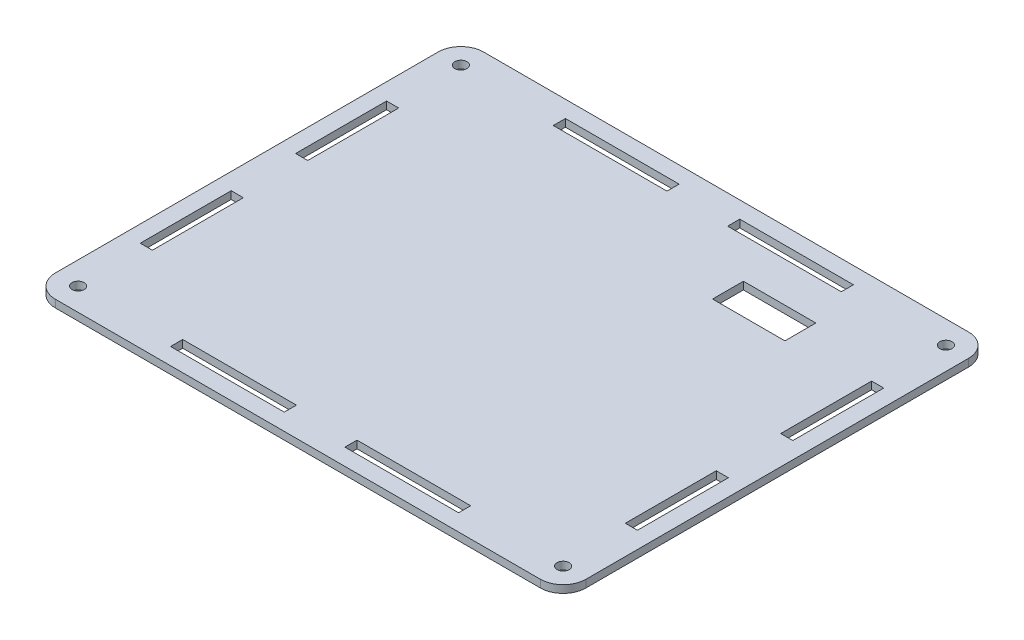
from build123d import *

# Parameters (mm, degrees)
SKETCH1_W           = 140
SKETCH1_H           = 113
SKETCH1_R           = 1.6
SKETCH1_W_2         = 3.2
SKETCH1_H_2         = 24
SKETCH1_W_3         = 30
SKETCH1_H_3         = 3.2
SKETCH1_W_4         = 19.1
SKETCH1_H_4         = 8.149746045
BOSS_EXTRUDE1_DEPTH = 2
FILLET1_R           = 6
FILLET2_R           = 6
FILLET3_R           = 6


with BuildPart() as part:
    # Sketch1 → Boss-Extrude1 (new body)
    with BuildSketch(Plane(origin=(0, 0, 0), x_dir=(1, 0, 0), z_dir=(0, 1, 0))):
        with Locations((70, 56.5)):
            Rectangle(SKETCH1_W, SKETCH1_H)
        with Locations(Location((6, 107, 0), (0, 0, 270))):
            Circle(SKETCH1_R, mode=Mode.SUBTRACT)
        with Locations(Location((134, 107, 0), (0, 0, 270))):
            Circle(SKETCH1_R, mode=Mode.SUBTRACT)
        with Locations(Location((134, 6, 0), (0, 0, 270))):
            Circle(SKETCH1_R, mode=Mode.SUBTRACT)
        with Locations(Location((6, 6, 0), (0, 0, 270))):
            Circle(SKETCH1_R, mode=Mode.SUBTRACT)
        with Locations((134, 36)):
            Rectangle(SKETCH1_W_2, SKETCH1_H_2, mode=Mode.SUBTRACT)
        with Locations((47, 6)):
            Rectangle(SKETCH1_W_3, SKETCH1_H_3, mode=Mode.SUBTRACT)
        with Locations((47, 107)):
            Rectangle(SKETCH1_W_3, SKETCH1_H_3, mode=Mode.SUBTRACT)
        with Locations((93, 6)):
            Rectangle(SKETCH1_W_3, SKETCH1_H_3, mode=Mode.SUBTRACT)
        with Locations((6, 77)):
            Rectangle(SKETCH1_W_2, SKETCH1_H_2, mode=Mode.SUBTRACT)
        with Locations((6, 36)):
            Rectangle(SKETCH1_W_2, SKETCH1_H_2, mode=Mode.SUBTRACT)
        with Locations((93, 107)):
            Rectangle(SKETCH1_W_3, SKETCH1_H_3, mode=Mode.SUBTRACT)
        with Locations((134, 77)):
            Rectangle(SKETCH1_W_2, SKETCH1_H_2, mode=Mode.SUBTRACT)
        with Locations((102.22, 90.825126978)):
            Rectangle(SKETCH1_W_4, SKETCH1_H_4, mode=Mode.SUBTRACT)
    extrude(amount=BOSS_EXTRUDE1_DEPTH)

    # Fillet1
    fillet1_edges = [part.edges().sort_by_distance(p)[0] for p in [
        (0, 1, -113),
    ]]
    fillet(fillet1_edges, radius=FILLET1_R)

    # Fillet2
    fillet2_edges = [part.edges().sort_by_distance(p)[0] for p in [
        (0, 1, 0),
    ]]
    fillet(fillet2_edges, radius=FILLET2_R)

    # Fillet3
    fillet3_edges = [part.edges().sort_by_distance(p)[0] for p in [
        (140, 1, -113),
        (140, 1, 0),
    ]]
    fillet(fillet3_edges, radius=FILLET3_R)


solid = part.part
